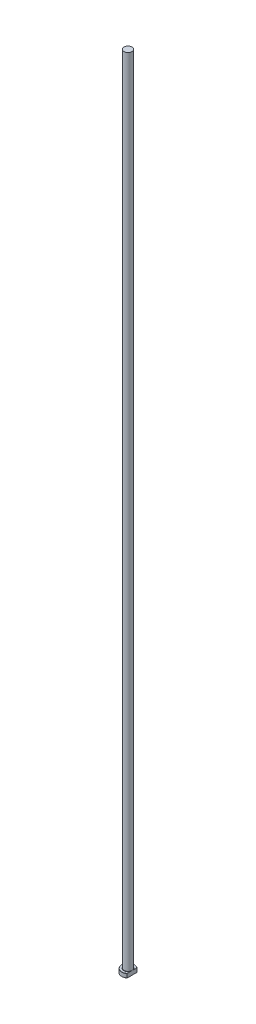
from build123d import *
from build123d.topology import SkipClean

# Parameters (mm, degrees)
CHAMFER1_SIZE = 0.2
FILLET1_R     = 0.3
KEY_DEPTH     = 1001.063997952


with BuildPart() as part:
    # Sketch1 → Revolve1 (revolve)
    with BuildSketch(Plane.XY, mode=Mode.PRIVATE) as revolve1_sk:
        Polygon((0, 0), (-8, 0), (-8, 5), (-5, 5), (-5, 1000), (0, 1000), align=None)
    revolve(revolve1_sk.sketch.rotate(Axis((0, 259.958771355, 0), (0, -1, 0)), 270), axis=Axis((0, 259.958771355, 0), (0, -1, 0)))

    # Chamfer1
    chamfer1_edges = [part.edges().sort_by_distance(p)[0] for p in [
        (0, 5, -8),
        (0, 0, -8),
    ]]
    chamfer(chamfer1_edges, length=CHAMFER1_SIZE)

    # Fillet1
    fillet1_edges = [part.edges().sort_by_distance(p)[0] for p in [
        (0, 5, -5),
    ]]
    fillet(fillet1_edges, radius=FILLET1_R)

    # Sketch2 → KEY (cut, through all)
    with SkipClean():  # the faces are left unmerged after this step: merging them gives an invalid solid
        with BuildSketch(Plane(origin=(0, 0, 0), x_dir=(1, 0, 0), z_dir=(0, 1, 0))):
            with BuildLine():
                Line((5, 6.244997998), (5, -6.244997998))
                ThreePointArc((5, -6.244997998), (8, 0), (5, 6.244997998))
            make_face()
        extrude(amount=KEY_DEPTH, mode=Mode.SUBTRACT)


solid = part.part
